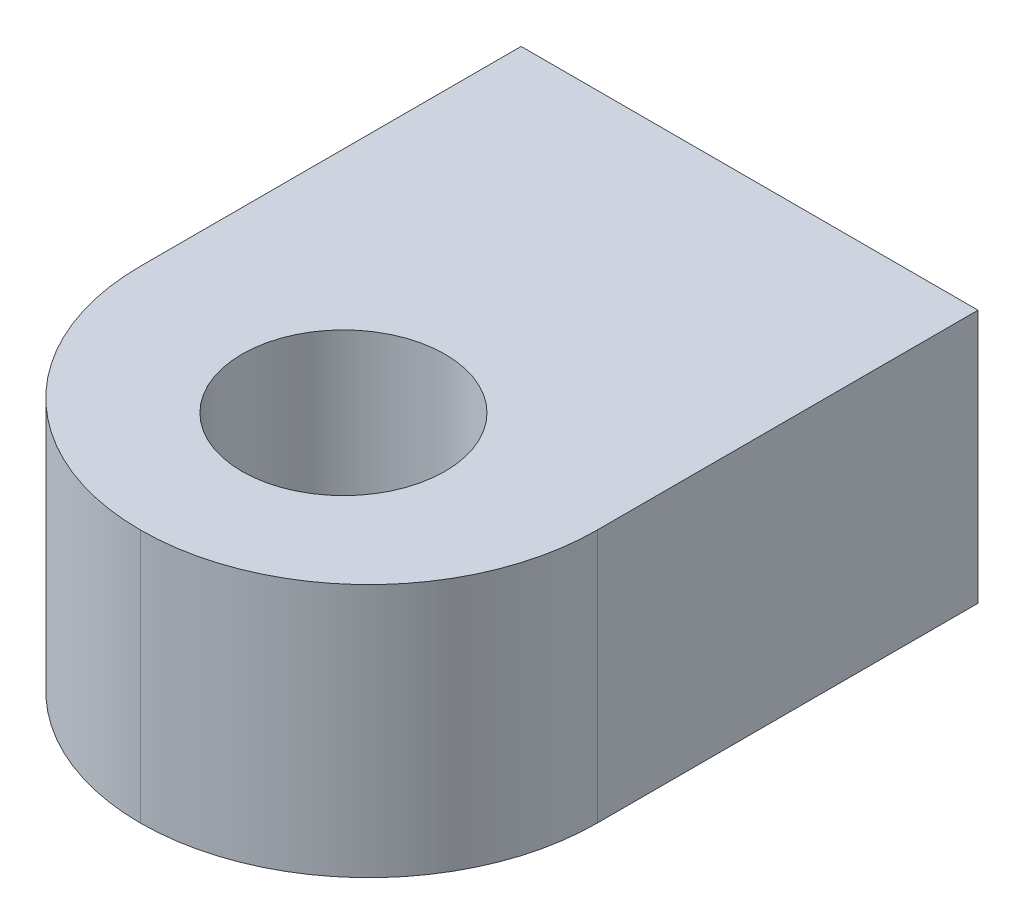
ISO-10303-21;
HEADER;
FILE_DESCRIPTION(('STEP AP214'),'2;1');
FILE_NAME('part.step','',(''),(''),'','','');
FILE_SCHEMA(('AUTOMOTIVE_DESIGN { 1 0 10303 214 1 1 1 1 }'));
ENDSEC;
DATA;
#1=APPLICATION_CONTEXT('core data for automotive mechanical design processes');
#2=APPLICATION_PROTOCOL_DEFINITION('international standard','automotive_design',2000,#1);
#3=PRODUCT_CONTEXT('',#1,'mechanical');
#4=PRODUCT('Part','Part','',(#3));
#5=PRODUCT_RELATED_PRODUCT_CATEGORY('part','',(#4));
#6=PRODUCT_DEFINITION_FORMATION('','',#4);
#7=PRODUCT_DEFINITION_CONTEXT('part definition',#1,'design');
#8=PRODUCT_DEFINITION('design','',#6,#7);
#9=PRODUCT_DEFINITION_SHAPE('','',#8);
#10=(LENGTH_UNIT() NAMED_UNIT(*) SI_UNIT(.MILLI.,.METRE.));
#11=(NAMED_UNIT(*) PLANE_ANGLE_UNIT() SI_UNIT($,.RADIAN.));
#12=(NAMED_UNIT(*) SI_UNIT($,.STERADIAN.) SOLID_ANGLE_UNIT());
#13=UNCERTAINTY_MEASURE_WITH_UNIT(LENGTH_MEASURE(1.E-05),#10,'distance_accuracy_value','');
#14=(GEOMETRIC_REPRESENTATION_CONTEXT(3) GLOBAL_UNCERTAINTY_ASSIGNED_CONTEXT((#13)) GLOBAL_UNIT_ASSIGNED_CONTEXT((#10,
#11,#12)) REPRESENTATION_CONTEXT('',''));
#15=CARTESIAN_POINT('',(0.,0.,0.));
#16=DIRECTION('',(0.,0.,1.));
#17=DIRECTION('',(1.,0.,0.));
#18=AXIS2_PLACEMENT_3D('',#15,#16,#17);
#19=CARTESIAN_POINT('',(0.,0.,60.));
#20=DIRECTION('',(1.,0.,0.));
#21=DIRECTION('',(0.,1.,0.));
#22=AXIS2_PLACEMENT_3D('',#19,#20,#21);
#23=PLANE('',#22);
#24=DIRECTION('',(0.,0.,-1.));
#25=VECTOR('',#24,1.);
#26=CARTESIAN_POINT('',(0.,0.,60.));
#27=LINE('',#26,#25);
#28=CARTESIAN_POINT('',(0.,0.,37.5));
#29=VERTEX_POINT('',#28);
#30=CARTESIAN_POINT('',(0.,0.,0.));
#31=VERTEX_POINT('',#30);
#32=EDGE_CURVE('E126',#29,#31,#27,.T.);
#33=ORIENTED_EDGE('',*,*,#32,.F.);
#34=DIRECTION('',(0.,-1.,0.));
#35=VECTOR('',#34,1.);
#36=CARTESIAN_POINT('',(0.,0.,37.5));
#37=LINE('',#36,#35);
#38=CARTESIAN_POINT('',(0.,25.,37.5));
#39=VERTEX_POINT('',#38);
#40=EDGE_CURVE('E132',#29,#39,#37,.F.);
#41=ORIENTED_EDGE('',*,*,#40,.T.);
#42=DIRECTION('',(0.,0.,-1.));
#43=VECTOR('',#42,1.);
#44=CARTESIAN_POINT('',(0.,25.,60.));
#45=LINE('',#44,#43);
#46=CARTESIAN_POINT('',(0.,25.,0.));
#47=VERTEX_POINT('',#46);
#48=EDGE_CURVE('E120',#39,#47,#45,.T.);
#49=ORIENTED_EDGE('',*,*,#48,.T.);
#50=DIRECTION('',(0.,-1.,0.));
#51=VECTOR('',#50,1.);
#52=CARTESIAN_POINT('',(0.,0.,0.));
#53=LINE('',#52,#51);
#54=EDGE_CURVE('E105',#47,#31,#53,.T.);
#55=ORIENTED_EDGE('',*,*,#54,.T.);
#56=EDGE_LOOP('',(#33,#41,#49,#55));
#57=FACE_BOUND('',#56,.T.);
#58=ADVANCED_FACE('F33',(#57),#23,.F.);
#59=CARTESIAN_POINT('',(0.,0.,60.));
#60=DIRECTION('',(0.,1.,0.));
#61=DIRECTION('',(0.,0.,1.));
#62=AXIS2_PLACEMENT_3D('',#59,#60,#61);
#63=PLANE('',#62);
#64=CARTESIAN_POINT('',(22.5,0.,40.));
#65=DIRECTION('',(0.,1.,0.));
#66=DIRECTION('',(0.,0.,1.));
#67=AXIS2_PLACEMENT_3D('',#64,#65,#66);
#68=CIRCLE('',#67,10.);
#69=CARTESIAN_POINT('',(22.5,0.,50.));
#70=VERTEX_POINT('',#69);
#71=EDGE_CURVE('E102',#70,#70,#68,.T.);
#72=ORIENTED_EDGE('',*,*,#71,.T.);
#73=EDGE_LOOP('',(#72));
#74=FACE_BOUND('',#73,.T.);
#75=CARTESIAN_POINT('',(22.5,0.,37.5));
#76=DIRECTION('',(0.,1.,0.));
#77=DIRECTION('',(0.,0.,1.));
#78=AXIS2_PLACEMENT_3D('',#75,#76,#77);
#79=CIRCLE('',#78,22.5);
#80=CARTESIAN_POINT('',(45.,0.,37.5));
#81=VERTEX_POINT('',#80);
#82=CARTESIAN_POINT('',(22.5,0.,60.));
#83=VERTEX_POINT('',#82);
#84=EDGE_CURVE('E128',#81,#83,#79,.F.);
#85=ORIENTED_EDGE('',*,*,#84,.T.);
#86=CARTESIAN_POINT('',(22.5,0.,37.5));
#87=DIRECTION('',(0.,1.,0.));
#88=DIRECTION('',(0.,0.,1.));
#89=AXIS2_PLACEMENT_3D('',#86,#87,#88);
#90=CIRCLE('',#89,22.5);
#91=EDGE_CURVE('E130',#83,#29,#90,.F.);
#92=ORIENTED_EDGE('',*,*,#91,.T.);
#93=ORIENTED_EDGE('',*,*,#32,.T.);
#94=DIRECTION('',(1.,0.,0.));
#95=VECTOR('',#94,1.);
#96=CARTESIAN_POINT('',(0.,0.,0.));
#97=LINE('',#96,#95);
#98=CARTESIAN_POINT('',(45.,0.,0.));
#99=VERTEX_POINT('',#98);
#100=EDGE_CURVE('E111',#31,#99,#97,.T.);
#101=ORIENTED_EDGE('',*,*,#100,.T.);
#102=DIRECTION('',(0.,0.,-1.));
#103=VECTOR('',#102,1.);
#104=CARTESIAN_POINT('',(45.,0.,60.));
#105=LINE('',#104,#103);
#106=EDGE_CURVE('E124',#81,#99,#105,.T.);
#107=ORIENTED_EDGE('',*,*,#106,.F.);
#108=EDGE_LOOP('',(#85,#92,#93,#101,#107));
#109=FACE_BOUND('',#108,.T.);
#110=ADVANCED_FACE('F150',(#74,#109),#63,.F.);
#111=CARTESIAN_POINT('',(45.,0.,60.));
#112=DIRECTION('',(-1.,0.,0.));
#113=DIRECTION('',(0.,-1.,0.));
#114=AXIS2_PLACEMENT_3D('',#111,#112,#113);
#115=PLANE('',#114);
#116=DIRECTION('',(0.,0.,-1.));
#117=VECTOR('',#116,1.);
#118=CARTESIAN_POINT('',(45.,25.,60.));
#119=LINE('',#118,#117);
#120=CARTESIAN_POINT('',(45.,25.,37.5));
#121=VERTEX_POINT('',#120);
#122=CARTESIAN_POINT('',(45.,25.,0.));
#123=VERTEX_POINT('',#122);
#124=EDGE_CURVE('E122',#121,#123,#119,.T.);
#125=ORIENTED_EDGE('',*,*,#124,.F.);
#126=DIRECTION('',(0.,1.,0.));
#127=VECTOR('',#126,1.);
#128=CARTESIAN_POINT('',(45.,0.,37.5));
#129=LINE('',#128,#127);
#130=EDGE_CURVE('E11',#121,#81,#129,.F.);
#131=ORIENTED_EDGE('',*,*,#130,.T.);
#132=ORIENTED_EDGE('',*,*,#106,.T.);
#133=DIRECTION('',(0.,1.,0.));
#134=VECTOR('',#133,1.);
#135=CARTESIAN_POINT('',(45.,0.,0.));
#136=LINE('',#135,#134);
#137=EDGE_CURVE('E114',#99,#123,#136,.T.);
#138=ORIENTED_EDGE('',*,*,#137,.T.);
#139=EDGE_LOOP('',(#125,#131,#132,#138));
#140=FACE_BOUND('',#139,.T.);
#141=ADVANCED_FACE('F158',(#140),#115,.F.);
#142=CARTESIAN_POINT('',(0.,25.,60.));
#143=DIRECTION('',(0.,-1.,0.));
#144=DIRECTION('',(0.,0.,-1.));
#145=AXIS2_PLACEMENT_3D('',#142,#143,#144);
#146=PLANE('',#145);
#147=CARTESIAN_POINT('',(22.5,25.,40.));
#148=DIRECTION('',(0.,1.,0.));
#149=DIRECTION('',(0.,0.,1.));
#150=AXIS2_PLACEMENT_3D('',#147,#148,#149);
#151=CIRCLE('',#150,10.);
#152=CARTESIAN_POINT('',(22.5,25.,50.));
#153=VERTEX_POINT('',#152);
#154=EDGE_CURVE('E106',#153,#153,#151,.T.);
#155=ORIENTED_EDGE('',*,*,#154,.F.);
#156=EDGE_LOOP('',(#155));
#157=FACE_BOUND('',#156,.T.);
#158=ORIENTED_EDGE('',*,*,#48,.F.);
#159=CARTESIAN_POINT('',(22.5,25.,37.5));
#160=DIRECTION('',(0.,-1.,0.));
#161=DIRECTION('',(0.,0.,-1.));
#162=AXIS2_PLACEMENT_3D('',#159,#160,#161);
#163=CIRCLE('',#162,22.5);
#164=CARTESIAN_POINT('',(22.5,25.,60.));
#165=VERTEX_POINT('',#164);
#166=EDGE_CURVE('E42',#39,#165,#163,.F.);
#167=ORIENTED_EDGE('',*,*,#166,.T.);
#168=CARTESIAN_POINT('',(22.5,25.,37.5));
#169=DIRECTION('',(0.,-1.,0.));
#170=DIRECTION('',(0.,0.,-1.));
#171=AXIS2_PLACEMENT_3D('',#168,#169,#170);
#172=CIRCLE('',#171,22.5);
#173=EDGE_CURVE('E49',#165,#121,#172,.F.);
#174=ORIENTED_EDGE('',*,*,#173,.T.);
#175=ORIENTED_EDGE('',*,*,#124,.T.);
#176=DIRECTION('',(-1.,0.,0.));
#177=VECTOR('',#176,1.);
#178=CARTESIAN_POINT('',(0.,25.,0.));
#179=LINE('',#178,#177);
#180=EDGE_CURVE('E117',#123,#47,#179,.T.);
#181=ORIENTED_EDGE('',*,*,#180,.T.);
#182=EDGE_LOOP('',(#158,#167,#174,#175,#181));
#183=FACE_BOUND('',#182,.T.);
#184=ADVANCED_FACE('F141',(#157,#183),#146,.F.);
#185=CARTESIAN_POINT('',(0.,25.,0.));
#186=DIRECTION('',(0.,0.,-1.));
#187=DIRECTION('',(-1.,0.,0.));
#188=AXIS2_PLACEMENT_3D('',#185,#186,#187);
#189=PLANE('',#188);
#190=CARTESIAN_POINT('',(37.5,12.5,0.));
#191=DIRECTION('',(0.,0.,-1.));
#192=DIRECTION('',(-1.,0.,0.));
#193=AXIS2_PLACEMENT_3D('',#190,#191,#192);
#194=CIRCLE('',#193,2.5);
#195=CARTESIAN_POINT('',(35.,12.5,0.));
#196=VERTEX_POINT('',#195);
#197=EDGE_CURVE('E92',#196,#196,#194,.T.);
#198=ORIENTED_EDGE('',*,*,#197,.F.);
#199=EDGE_LOOP('',(#198));
#200=FACE_BOUND('',#199,.T.);
#201=CARTESIAN_POINT('',(7.5,12.5,0.));
#202=DIRECTION('',(0.,0.,-1.));
#203=DIRECTION('',(-1.,0.,0.));
#204=AXIS2_PLACEMENT_3D('',#201,#202,#203);
#205=CIRCLE('',#204,2.5);
#206=CARTESIAN_POINT('',(5.,12.5,0.));
#207=VERTEX_POINT('',#206);
#208=EDGE_CURVE('E91',#207,#207,#205,.T.);
#209=ORIENTED_EDGE('',*,*,#208,.F.);
#210=EDGE_LOOP('',(#209));
#211=FACE_BOUND('',#210,.T.);
#212=ORIENTED_EDGE('',*,*,#54,.F.);
#213=ORIENTED_EDGE('',*,*,#180,.F.);
#214=ORIENTED_EDGE('',*,*,#137,.F.);
#215=ORIENTED_EDGE('',*,*,#100,.F.);
#216=EDGE_LOOP('',(#212,#213,#214,#215));
#217=FACE_BOUND('',#216,.T.);
#218=ADVANCED_FACE('F147',(#200,#211,#217),#189,.T.);
#219=CARTESIAN_POINT('',(22.5,0.,40.));
#220=DIRECTION('',(0.,1.,0.));
#221=DIRECTION('',(0.,0.,1.));
#222=AXIS2_PLACEMENT_3D('',#219,#220,#221);
#223=CYLINDRICAL_SURFACE('',#222,10.);
#224=ORIENTED_EDGE('',*,*,#71,.F.);
#225=EDGE_LOOP('',(#224));
#226=FACE_BOUND('',#225,.T.);
#227=ORIENTED_EDGE('',*,*,#154,.T.);
#228=EDGE_LOOP('',(#227));
#229=FACE_BOUND('',#228,.T.);
#230=ADVANCED_FACE('F181',(#226,#229),#223,.F.);
#231=CARTESIAN_POINT('',(22.5,25.,37.5));
#232=DIRECTION('',(0.,1.,0.));
#233=DIRECTION('',(-1.,0.,0.));
#234=AXIS2_PLACEMENT_3D('',#231,#232,#233);
#235=CYLINDRICAL_SURFACE('',#234,22.5);
#236=ORIENTED_EDGE('',*,*,#130,.F.);
#237=ORIENTED_EDGE('',*,*,#173,.F.);
#238=DIRECTION('',(0.,1.,0.));
#239=VECTOR('',#238,1.);
#240=CARTESIAN_POINT('',(22.5,25.,60.));
#241=LINE('',#240,#239);
#242=EDGE_CURVE('E37',#83,#165,#241,.T.);
#243=ORIENTED_EDGE('',*,*,#242,.F.);
#244=ORIENTED_EDGE('',*,*,#84,.F.);
#245=EDGE_LOOP('',(#236,#237,#243,#244));
#246=FACE_BOUND('',#245,.T.);
#247=ADVANCED_FACE('F35',(#246),#235,.T.);
#248=CARTESIAN_POINT('',(22.5,25.,37.5));
#249=DIRECTION('',(0.,-1.,0.));
#250=DIRECTION('',(1.,0.,0.));
#251=AXIS2_PLACEMENT_3D('',#248,#249,#250);
#252=CYLINDRICAL_SURFACE('',#251,22.5);
#253=ORIENTED_EDGE('',*,*,#166,.F.);
#254=ORIENTED_EDGE('',*,*,#40,.F.);
#255=ORIENTED_EDGE('',*,*,#91,.F.);
#256=ORIENTED_EDGE('',*,*,#242,.T.);
#257=EDGE_LOOP('',(#253,#254,#255,#256));
#258=FACE_BOUND('',#257,.T.);
#259=ADVANCED_FACE('F154',(#258),#252,.T.);
#260=CARTESIAN_POINT('',(7.5,12.5,15.));
#261=DIRECTION('',(0.,0.,-1.));
#262=DIRECTION('',(-1.,0.,0.));
#263=AXIS2_PLACEMENT_3D('',#260,#261,#262);
#264=CONICAL_SURFACE('',#263,2.5,1.02974425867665);
#265=CARTESIAN_POINT('',(7.49999999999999,12.5,16.5021515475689));
#266=VERTEX_POINT('',#265);
#267=VERTEX_LOOP('',#266);
#268=FACE_BOUND('',#267,.T.);
#269=CARTESIAN_POINT('',(7.5,12.5,15.));
#270=DIRECTION('',(0.,0.,-1.));
#271=DIRECTION('',(-1.,0.,0.));
#272=AXIS2_PLACEMENT_3D('',#269,#270,#271);
#273=CIRCLE('',#272,2.5);
#274=CARTESIAN_POINT('',(5.,12.5,15.));
#275=VERTEX_POINT('',#274);
#276=EDGE_CURVE('E95',#275,#275,#273,.T.);
#277=ORIENTED_EDGE('',*,*,#276,.T.);
#278=EDGE_LOOP('',(#277));
#279=FACE_BOUND('',#278,.T.);
#280=ADVANCED_FACE('F174',(#268,#279),#264,.F.);
#281=CARTESIAN_POINT('',(7.5,12.5,0.));
#282=DIRECTION('',(0.,0.,-1.));
#283=DIRECTION('',(-1.,0.,0.));
#284=AXIS2_PLACEMENT_3D('',#281,#282,#283);
#285=CYLINDRICAL_SURFACE('',#284,2.5);
#286=ORIENTED_EDGE('',*,*,#276,.F.);
#287=EDGE_LOOP('',(#286));
#288=FACE_BOUND('',#287,.T.);
#289=ORIENTED_EDGE('',*,*,#208,.T.);
#290=EDGE_LOOP('',(#289));
#291=FACE_BOUND('',#290,.T.);
#292=ADVANCED_FACE('F85',(#288,#291),#285,.F.);
#293=CARTESIAN_POINT('',(37.5,12.5,15.));
#294=DIRECTION('',(0.,0.,-1.));
#295=DIRECTION('',(-1.,0.,0.));
#296=AXIS2_PLACEMENT_3D('',#293,#294,#295);
#297=CONICAL_SURFACE('',#296,2.5,1.02974425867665);
#298=CARTESIAN_POINT('',(37.5,12.5,16.5021515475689));
#299=VERTEX_POINT('',#298);
#300=VERTEX_LOOP('',#299);
#301=FACE_BOUND('',#300,.T.);
#302=CARTESIAN_POINT('',(37.5,12.5,15.));
#303=DIRECTION('',(0.,0.,-1.));
#304=DIRECTION('',(-1.,0.,0.));
#305=AXIS2_PLACEMENT_3D('',#302,#303,#304);
#306=CIRCLE('',#305,2.5);
#307=CARTESIAN_POINT('',(35.,12.5,15.));
#308=VERTEX_POINT('',#307);
#309=EDGE_CURVE('E89',#308,#308,#306,.T.);
#310=ORIENTED_EDGE('',*,*,#309,.T.);
#311=EDGE_LOOP('',(#310));
#312=FACE_BOUND('',#311,.T.);
#313=ADVANCED_FACE('F81',(#301,#312),#297,.F.);
#314=CARTESIAN_POINT('',(37.5,12.5,0.));
#315=DIRECTION('',(0.,0.,-1.));
#316=DIRECTION('',(-1.,0.,0.));
#317=AXIS2_PLACEMENT_3D('',#314,#315,#316);
#318=CYLINDRICAL_SURFACE('',#317,2.5);
#319=ORIENTED_EDGE('',*,*,#309,.F.);
#320=EDGE_LOOP('',(#319));
#321=FACE_BOUND('',#320,.T.);
#322=ORIENTED_EDGE('',*,*,#197,.T.);
#323=EDGE_LOOP('',(#322));
#324=FACE_BOUND('',#323,.T.);
#325=ADVANCED_FACE('F84',(#321,#324),#318,.F.);
#326=CLOSED_SHELL('',(#58,#110,#141,#184,#218,#230,#247,#259,#280,#292,#313,#325));
#327=MANIFOLD_SOLID_BREP('B2',#326);
#328=ADVANCED_BREP_SHAPE_REPRESENTATION('',(#18,#327),#14);
#329=SHAPE_DEFINITION_REPRESENTATION(#9,#328);
ENDSEC;
END-ISO-10303-21;
